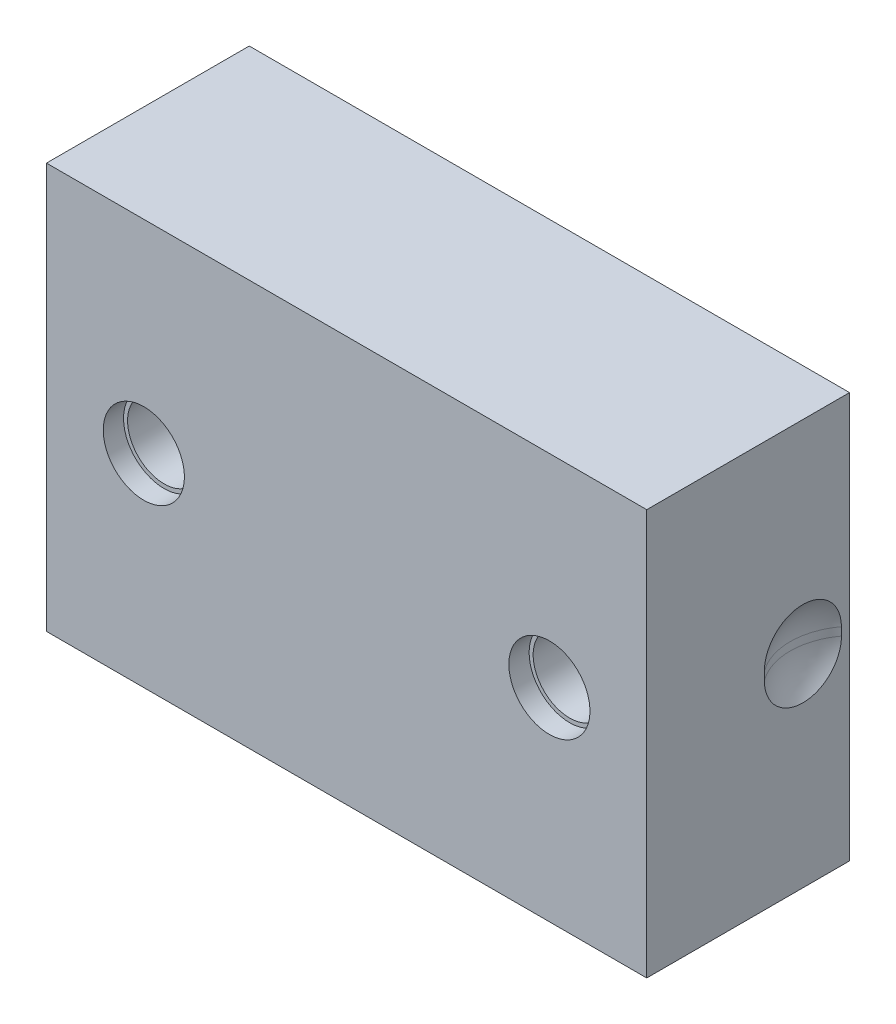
ISO-10303-21;
HEADER;
FILE_DESCRIPTION(('STEP AP214'),'2;1');
FILE_NAME('part.step','',(''),(''),'','','');
FILE_SCHEMA(('AUTOMOTIVE_DESIGN { 1 0 10303 214 1 1 1 1 }'));
ENDSEC;
DATA;
#1=APPLICATION_CONTEXT('core data for automotive mechanical design processes');
#2=APPLICATION_PROTOCOL_DEFINITION('international standard','automotive_design',2000,#1);
#3=PRODUCT_CONTEXT('',#1,'mechanical');
#4=PRODUCT('Part','Part','',(#3));
#5=PRODUCT_RELATED_PRODUCT_CATEGORY('part','',(#4));
#6=PRODUCT_DEFINITION_FORMATION('','',#4);
#7=PRODUCT_DEFINITION_CONTEXT('part definition',#1,'design');
#8=PRODUCT_DEFINITION('design','',#6,#7);
#9=PRODUCT_DEFINITION_SHAPE('','',#8);
#10=(LENGTH_UNIT() NAMED_UNIT(*) SI_UNIT(.MILLI.,.METRE.));
#11=(NAMED_UNIT(*) PLANE_ANGLE_UNIT() SI_UNIT($,.RADIAN.));
#12=(NAMED_UNIT(*) SI_UNIT($,.STERADIAN.) SOLID_ANGLE_UNIT());
#13=UNCERTAINTY_MEASURE_WITH_UNIT(LENGTH_MEASURE(1.E-05),#10,'distance_accuracy_value','');
#14=(GEOMETRIC_REPRESENTATION_CONTEXT(3) GLOBAL_UNCERTAINTY_ASSIGNED_CONTEXT((#13)) GLOBAL_UNIT_ASSIGNED_CONTEXT((#10,
#11,#12)) REPRESENTATION_CONTEXT('',''));
#15=CARTESIAN_POINT('',(0.,0.,0.));
#16=DIRECTION('',(0.,0.,1.));
#17=DIRECTION('',(1.,0.,0.));
#18=AXIS2_PLACEMENT_3D('',#15,#16,#17);
#19=CARTESIAN_POINT('',(-174.500411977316,-24.0004119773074,79.5));
#20=DIRECTION('',(0.,0.,-1.));
#21=DIRECTION('',(-1.,0.,0.));
#22=AXIS2_PLACEMENT_3D('',#19,#20,#21);
#23=PLANE('',#22);
#24=CARTESIAN_POINT('',(-174.500411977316,-24.0004119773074,79.5));
#25=DIRECTION('',(0.,0.,1.));
#26=DIRECTION('',(1.,0.,0.));
#27=AXIS2_PLACEMENT_3D('',#24,#25,#26);
#28=CIRCLE('',#27,9.);
#29=CARTESIAN_POINT('',(-165.500411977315,-24.0004119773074,79.5));
#30=VERTEX_POINT('',#29);
#31=EDGE_CURVE('E18',#30,#30,#28,.T.);
#32=ORIENTED_EDGE('',*,*,#31,.T.);
#33=EDGE_LOOP('',(#32));
#34=FACE_BOUND('',#33,.T.);
#35=CARTESIAN_POINT('',(-174.500411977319,-24.0004119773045,79.4999999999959));
#36=DIRECTION('',(0.,0.,1.));
#37=DIRECTION('',(1.,0.,0.));
#38=AXIS2_PLACEMENT_3D('',#35,#36,#37);
#39=CIRCLE('',#38,6.00000000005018);
#40=CARTESIAN_POINT('',(-168.500411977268,-24.0004119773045,79.4999999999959));
#41=VERTEX_POINT('',#40);
#42=EDGE_CURVE('E288',#41,#41,#39,.F.);
#43=ORIENTED_EDGE('',*,*,#42,.T.);
#44=EDGE_LOOP('',(#43));
#45=FACE_BOUND('',#44,.T.);
#46=ADVANCED_FACE('F14',(#34,#45),#23,.F.);
#47=CARTESIAN_POINT('',(-74.5004119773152,-24.0004119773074,99.5));
#48=DIRECTION('',(0.,0.,1.));
#49=DIRECTION('',(1.,0.,0.));
#50=AXIS2_PLACEMENT_3D('',#47,#48,#49);
#51=CYLINDRICAL_SURFACE('',#50,9.);
#52=CARTESIAN_POINT('',(-74.5004119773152,-24.0004119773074,79.5));
#53=DIRECTION('',(0.,0.,1.));
#54=DIRECTION('',(1.,0.,0.));
#55=AXIS2_PLACEMENT_3D('',#52,#53,#54);
#56=CIRCLE('',#55,9.);
#57=CARTESIAN_POINT('',(-65.5004119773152,-24.0004119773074,79.5));
#58=VERTEX_POINT('',#57);
#59=EDGE_CURVE('E290',#58,#58,#56,.F.);
#60=ORIENTED_EDGE('',*,*,#59,.T.);
#61=EDGE_LOOP('',(#60));
#62=FACE_BOUND('',#61,.T.);
#63=CARTESIAN_POINT('',(-74.5004119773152,-24.0004119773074,114.5));
#64=DIRECTION('',(0.,0.,1.));
#65=DIRECTION('',(1.,0.,0.));
#66=AXIS2_PLACEMENT_3D('',#63,#64,#65);
#67=CIRCLE('',#66,9.);
#68=CARTESIAN_POINT('',(-65.5004119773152,-24.0004119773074,114.5));
#69=VERTEX_POINT('',#68);
#70=EDGE_CURVE('E285',#69,#69,#67,.T.);
#71=ORIENTED_EDGE('',*,*,#70,.T.);
#72=EDGE_LOOP('',(#71));
#73=FACE_BOUND('',#72,.T.);
#74=ADVANCED_FACE('F303',(#62,#73),#51,.F.);
#75=CARTESIAN_POINT('',(-174.500411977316,-24.0004119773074,99.5));
#76=DIRECTION('',(0.,0.,1.));
#77=DIRECTION('',(1.,0.,0.));
#78=AXIS2_PLACEMENT_3D('',#75,#76,#77);
#79=CYLINDRICAL_SURFACE('',#78,9.);
#80=ORIENTED_EDGE('',*,*,#31,.F.);
#81=EDGE_LOOP('',(#80));
#82=FACE_BOUND('',#81,.T.);
#83=CARTESIAN_POINT('',(-174.500411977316,-24.0004119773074,114.5));
#84=DIRECTION('',(0.,0.,1.));
#85=DIRECTION('',(1.,0.,0.));
#86=AXIS2_PLACEMENT_3D('',#83,#84,#85);
#87=CIRCLE('',#86,9.);
#88=CARTESIAN_POINT('',(-165.500411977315,-24.0004119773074,114.5));
#89=VERTEX_POINT('',#88);
#90=EDGE_CURVE('E282',#89,#89,#87,.T.);
#91=ORIENTED_EDGE('',*,*,#90,.T.);
#92=EDGE_LOOP('',(#91));
#93=FACE_BOUND('',#92,.T.);
#94=ADVANCED_FACE('F299',(#82,#93),#79,.F.);
#95=CARTESIAN_POINT('',(-74.5004119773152,-24.0004119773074,79.5));
#96=DIRECTION('',(0.,0.,-1.));
#97=DIRECTION('',(-1.,0.,0.));
#98=AXIS2_PLACEMENT_3D('',#95,#96,#97);
#99=PLANE('',#98);
#100=ORIENTED_EDGE('',*,*,#59,.F.);
#101=EDGE_LOOP('',(#100));
#102=FACE_BOUND('',#101,.T.);
#103=CARTESIAN_POINT('',(-74.5004119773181,-24.0004119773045,79.5000000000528));
#104=DIRECTION('',(0.,0.,1.));
#105=DIRECTION('',(1.,0.,0.));
#106=AXIS2_PLACEMENT_3D('',#103,#104,#105);
#107=CIRCLE('',#106,6.0000000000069);
#108=CARTESIAN_POINT('',(-68.5004119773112,-24.0004119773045,79.5000000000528));
#109=VERTEX_POINT('',#108);
#110=EDGE_CURVE('E215',#109,#109,#107,.F.);
#111=ORIENTED_EDGE('',*,*,#110,.T.);
#112=EDGE_LOOP('',(#111));
#113=FACE_BOUND('',#112,.T.);
#114=ADVANCED_FACE('F302',(#102,#113),#99,.F.);
#115=CARTESIAN_POINT('',(-174.500411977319,-24.0004119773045,79.4999999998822));
#116=DIRECTION('',(0.,0.,1.));
#117=DIRECTION('',(1.,0.,0.));
#118=AXIS2_PLACEMENT_3D('',#115,#116,#117);
#119=CONICAL_SURFACE('',#118,5.99999999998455,0.523598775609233);
#120=ORIENTED_EDGE('',*,*,#42,.F.);
#121=EDGE_LOOP('',(#120));
#122=FACE_BOUND('',#121,.T.);
#123=CARTESIAN_POINT('',(-174.500411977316,-24.0004119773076,78.2009618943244));
#124=DIRECTION('',(1.81804897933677E-13,-1.75169682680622E-13,-1.));
#125=DIRECTION('',(-1.,0.,-1.81804897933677E-13));
#126=AXIS2_PLACEMENT_3D('',#123,#124,#125);
#127=CIRCLE('',#126,5.25);
#128=CARTESIAN_POINT('',(-179.750411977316,-24.0004119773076,78.2009618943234));
#129=VERTEX_POINT('',#128);
#130=EDGE_CURVE('E211',#129,#129,#127,.T.);
#131=ORIENTED_EDGE('',*,*,#130,.T.);
#132=EDGE_LOOP('',(#131));
#133=FACE_BOUND('',#132,.T.);
#134=ADVANCED_FACE('F321',(#122,#133),#119,.F.);
#135=CARTESIAN_POINT('',(-74.5004119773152,-24.0004119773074,114.5));
#136=DIRECTION('',(0.,0.,-1.));
#137=DIRECTION('',(-1.,0.,0.));
#138=AXIS2_PLACEMENT_3D('',#135,#136,#137);
#139=PLANE('',#138);
#140=CARTESIAN_POINT('',(-74.5004119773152,-24.0004119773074,114.5));
#141=DIRECTION('',(0.,0.,-1.));
#142=DIRECTION('',(-1.,0.,0.));
#143=AXIS2_PLACEMENT_3D('',#140,#141,#142);
#144=CIRCLE('',#143,10.);
#145=CARTESIAN_POINT('',(-84.5004119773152,-24.0004119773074,114.5));
#146=VERTEX_POINT('',#145);
#147=EDGE_CURVE('E214',#146,#146,#144,.F.);
#148=ORIENTED_EDGE('',*,*,#147,.T.);
#149=EDGE_LOOP('',(#148));
#150=FACE_BOUND('',#149,.T.);
#151=ORIENTED_EDGE('',*,*,#70,.F.);
#152=EDGE_LOOP('',(#151));
#153=FACE_BOUND('',#152,.T.);
#154=ADVANCED_FACE('F310',(#150,#153),#139,.F.);
#155=CARTESIAN_POINT('',(-174.500411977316,-24.0004119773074,114.5));
#156=DIRECTION('',(0.,0.,-1.));
#157=DIRECTION('',(-1.,0.,0.));
#158=AXIS2_PLACEMENT_3D('',#155,#156,#157);
#159=PLANE('',#158);
#160=CARTESIAN_POINT('',(-174.500411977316,-24.0004119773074,114.5));
#161=DIRECTION('',(0.,0.,-1.));
#162=DIRECTION('',(-1.,0.,0.));
#163=AXIS2_PLACEMENT_3D('',#160,#161,#162);
#164=CIRCLE('',#163,10.);
#165=CARTESIAN_POINT('',(-184.500411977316,-24.0004119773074,114.5));
#166=VERTEX_POINT('',#165);
#167=EDGE_CURVE('E218',#166,#166,#164,.F.);
#168=ORIENTED_EDGE('',*,*,#167,.T.);
#169=EDGE_LOOP('',(#168));
#170=FACE_BOUND('',#169,.T.);
#171=ORIENTED_EDGE('',*,*,#90,.F.);
#172=EDGE_LOOP('',(#171));
#173=FACE_BOUND('',#172,.T.);
#174=ADVANCED_FACE('F307',(#170,#173),#159,.F.);
#175=CARTESIAN_POINT('',(-74.5004119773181,-24.0004119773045,79.5000000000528));
#176=DIRECTION('',(0.,0.,1.));
#177=DIRECTION('',(1.,0.,0.));
#178=AXIS2_PLACEMENT_3D('',#175,#176,#177);
#179=CONICAL_SURFACE('',#178,6.0000000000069,0.523598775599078);
#180=ORIENTED_EDGE('',*,*,#110,.F.);
#181=EDGE_LOOP('',(#180));
#182=FACE_BOUND('',#181,.T.);
#183=CARTESIAN_POINT('',(-74.5004119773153,-24.0004119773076,78.2009618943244));
#184=DIRECTION('',(1.81804897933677E-13,-1.75169682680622E-13,-1.));
#185=DIRECTION('',(-1.,0.,-1.81804897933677E-13));
#186=AXIS2_PLACEMENT_3D('',#183,#184,#185);
#187=CIRCLE('',#186,5.25);
#188=CARTESIAN_POINT('',(-79.7504119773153,-24.0004119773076,78.2009618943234));
#189=VERTEX_POINT('',#188);
#190=EDGE_CURVE('E216',#189,#189,#187,.T.);
#191=ORIENTED_EDGE('',*,*,#190,.T.);
#192=EDGE_LOOP('',(#191));
#193=FACE_BOUND('',#192,.T.);
#194=ADVANCED_FACE('F309',(#182,#193),#179,.F.);
#195=CARTESIAN_POINT('',(-174.500411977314,-24.0004119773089,71.));
#196=DIRECTION('',(1.81804897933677E-13,-1.75169682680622E-13,-1.));
#197=DIRECTION('',(-1.,0.,-1.81804897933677E-13));
#198=AXIS2_PLACEMENT_3D('',#195,#196,#197);
#199=CYLINDRICAL_SURFACE('',#198,5.25);
#200=CARTESIAN_POINT('',(-174.500411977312,-24.0004119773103,62.4999999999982));
#201=DIRECTION('',(1.81804897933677E-13,-1.75169682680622E-13,-1.));
#202=DIRECTION('',(-1.,0.,-1.81804897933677E-13));
#203=AXIS2_PLACEMENT_3D('',#200,#201,#202);
#204=CIRCLE('',#203,5.25);
#205=CARTESIAN_POINT('',(-179.750411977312,-24.0004119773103,62.4999999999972));
#206=VERTEX_POINT('',#205);
#207=EDGE_CURVE('E80',#206,#206,#204,.F.);
#208=ORIENTED_EDGE('',*,*,#207,.F.);
#209=EDGE_LOOP('',(#208));
#210=FACE_BOUND('',#209,.T.);
#211=ORIENTED_EDGE('',*,*,#130,.F.);
#212=EDGE_LOOP('',(#211));
#213=FACE_BOUND('',#212,.T.);
#214=ADVANCED_FACE('F318',(#210,#213),#199,.F.);
#215=CARTESIAN_POINT('',(-74.5004119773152,-24.0004119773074,117.));
#216=DIRECTION('',(0.,0.,-1.));
#217=DIRECTION('',(-1.,0.,0.));
#218=AXIS2_PLACEMENT_3D('',#215,#216,#217);
#219=CYLINDRICAL_SURFACE('',#218,10.);
#220=CARTESIAN_POINT('',(-74.5004119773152,-24.0004119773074,119.5));
#221=DIRECTION('',(0.,0.,-1.));
#222=DIRECTION('',(-1.,0.,0.));
#223=AXIS2_PLACEMENT_3D('',#220,#221,#222);
#224=CIRCLE('',#223,10.);
#225=CARTESIAN_POINT('',(-84.5004119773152,-24.0004119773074,119.5));
#226=VERTEX_POINT('',#225);
#227=EDGE_CURVE('E265',#226,#226,#224,.F.);
#228=ORIENTED_EDGE('',*,*,#227,.T.);
#229=EDGE_LOOP('',(#228));
#230=FACE_BOUND('',#229,.T.);
#231=ORIENTED_EDGE('',*,*,#147,.F.);
#232=EDGE_LOOP('',(#231));
#233=FACE_BOUND('',#232,.T.);
#234=ADVANCED_FACE('F328',(#230,#233),#219,.F.);
#235=CARTESIAN_POINT('',(-174.500411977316,-24.0004119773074,117.));
#236=DIRECTION('',(0.,0.,-1.));
#237=DIRECTION('',(-1.,0.,0.));
#238=AXIS2_PLACEMENT_3D('',#235,#236,#237);
#239=CYLINDRICAL_SURFACE('',#238,10.);
#240=CARTESIAN_POINT('',(-174.500411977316,-24.0004119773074,119.5));
#241=DIRECTION('',(0.,0.,-1.));
#242=DIRECTION('',(-1.,0.,0.));
#243=AXIS2_PLACEMENT_3D('',#240,#241,#242);
#244=CIRCLE('',#243,10.);
#245=CARTESIAN_POINT('',(-184.500411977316,-24.0004119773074,119.5));
#246=VERTEX_POINT('',#245);
#247=EDGE_CURVE('E268',#246,#246,#244,.F.);
#248=ORIENTED_EDGE('',*,*,#247,.T.);
#249=EDGE_LOOP('',(#248));
#250=FACE_BOUND('',#249,.T.);
#251=ORIENTED_EDGE('',*,*,#167,.F.);
#252=EDGE_LOOP('',(#251));
#253=FACE_BOUND('',#252,.T.);
#254=ADVANCED_FACE('F332',(#250,#253),#239,.F.);
#255=CARTESIAN_POINT('',(-74.500411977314,-24.0004119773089,71.));
#256=DIRECTION('',(1.81804897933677E-13,-1.75169682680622E-13,-1.));
#257=DIRECTION('',(-1.,0.,-1.81804897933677E-13));
#258=AXIS2_PLACEMENT_3D('',#255,#256,#257);
#259=CYLINDRICAL_SURFACE('',#258,5.25);
#260=CARTESIAN_POINT('',(-74.5004119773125,-24.0004119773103,62.4999999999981));
#261=DIRECTION('',(1.81804897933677E-13,-1.75169682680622E-13,-1.));
#262=DIRECTION('',(-1.,0.,-1.81804897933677E-13));
#263=AXIS2_PLACEMENT_3D('',#260,#261,#262);
#264=CIRCLE('',#263,5.25);
#265=CARTESIAN_POINT('',(-79.7504119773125,-24.0004119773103,62.4999999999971));
#266=VERTEX_POINT('',#265);
#267=EDGE_CURVE('E540',#266,#266,#264,.F.);
#268=ORIENTED_EDGE('',*,*,#267,.F.);
#269=EDGE_LOOP('',(#268));
#270=FACE_BOUND('',#269,.T.);
#271=ORIENTED_EDGE('',*,*,#190,.F.);
#272=EDGE_LOOP('',(#271));
#273=FACE_BOUND('',#272,.T.);
#274=ADVANCED_FACE('F336',(#270,#273),#259,.F.);
#275=CARTESIAN_POINT('',(-166.045797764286,-20.9150435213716,62.5));
#276=DIRECTION('',(0.,0.,-1.));
#277=DIRECTION('',(-1.,0.,0.));
#278=AXIS2_PLACEMENT_3D('',#275,#276,#277);
#279=PLANE('',#278);
#280=CARTESIAN_POINT('',(-174.500411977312,-24.0004119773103,62.5));
#281=DIRECTION('',(0.,0.,-1.));
#282=DIRECTION('',(-1.,0.,0.));
#283=AXIS2_PLACEMENT_3D('',#280,#281,#282);
#284=CIRCLE('',#283,9.);
#285=CARTESIAN_POINT('',(-183.500411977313,-24.0004119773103,62.5));
#286=VERTEX_POINT('',#285);
#287=EDGE_CURVE('E89',#286,#286,#284,.F.);
#288=ORIENTED_EDGE('',*,*,#287,.F.);
#289=EDGE_LOOP('',(#288));
#290=FACE_BOUND('',#289,.T.);
#291=ORIENTED_EDGE('',*,*,#207,.T.);
#292=EDGE_LOOP('',(#291));
#293=FACE_BOUND('',#292,.T.);
#294=ADVANCED_FACE('F339',(#290,#293),#279,.T.);
#295=CARTESIAN_POINT('',(-211.250411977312,-25.0005435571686,81.));
#296=DIRECTION('',(0.496405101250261,0.278948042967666,0.822052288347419));
#297=DIRECTION('',(0.0314750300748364,0.940559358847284,-0.338167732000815));
#298=AXIS2_PLACEMENT_3D('',#295,#296,#297);
#299=SPHERICAL_SURFACE('',#298,15.9);
#300=CARTESIAN_POINT('',(-211.250411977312,-25.0005435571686,81.));
#301=DIRECTION('',(0.,-1.,0.));
#302=DIRECTION('',(0.,0.,-1.));
#303=AXIS2_PLACEMENT_3D('',#300,#301,#302);
#304=CIRCLE('',#303,15.9);
#305=CARTESIAN_POINT('',(-198.500411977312,-25.0005435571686,90.4998684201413));
#306=VERTEX_POINT('',#305);
#307=CARTESIAN_POINT('',(-198.500411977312,-25.0005435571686,71.5001315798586));
#308=VERTEX_POINT('',#307);
#309=EDGE_CURVE('E74',#306,#308,#304,.F.);
#310=ORIENTED_EDGE('',*,*,#309,.T.);
#311=CARTESIAN_POINT('',(-198.500411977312,-25.0005435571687,71.5001315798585));
#312=CARTESIAN_POINT('',(-198.500411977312,-25.2677303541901,71.5001028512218));
#313=CARTESIAN_POINT('',(-198.500411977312,-25.5349130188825,71.5114024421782));
#314=CARTESIAN_POINT('',(-198.500411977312,-26.0673668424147,71.556450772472));
#315=CARTESIAN_POINT('',(-198.500411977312,-26.3326380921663,71.5901984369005));
#316=CARTESIAN_POINT('',(-198.500411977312,-26.8592066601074,71.6799039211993));
#317=CARTESIAN_POINT('',(-198.500411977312,-27.1205066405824,71.7358461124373));
#318=CARTESIAN_POINT('',(-198.500411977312,-27.6374645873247,71.8695336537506));
#319=CARTESIAN_POINT('',(-198.500411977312,-27.8931226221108,71.9472787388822));
#320=CARTESIAN_POINT('',(-198.500411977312,-28.3970996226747,72.1240632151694));
#321=CARTESIAN_POINT('',(-198.500411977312,-28.6454151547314,72.2231123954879));
#322=CARTESIAN_POINT('',(-198.500411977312,-29.1328237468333,72.4417813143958));
#323=CARTESIAN_POINT('',(-198.500411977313,-29.3719166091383,72.5614014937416));
#324=CARTESIAN_POINT('',(-198.500411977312,-29.8391260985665,72.8203339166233));
#325=CARTESIAN_POINT('',(-198.500411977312,-30.0672449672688,72.9596421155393));
#326=CARTESIAN_POINT('',(-198.500411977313,-30.5109364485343,73.2569781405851));
#327=CARTESIAN_POINT('',(-198.500411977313,-30.7265091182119,73.4150058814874));
#328=CARTESIAN_POINT('',(-198.500411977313,-31.1435843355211,73.7486640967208));
#329=CARTESIAN_POINT('',(-198.500411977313,-31.3450863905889,73.924295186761));
#330=CARTESIAN_POINT('',(-198.500411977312,-31.7325755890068,74.2919030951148));
#331=CARTESIAN_POINT('',(-198.500411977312,-31.9185630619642,74.4838795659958));
#332=CARTESIAN_POINT('',(-198.500411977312,-32.2737349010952,74.8828494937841));
#333=CARTESIAN_POINT('',(-198.500411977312,-32.442916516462,75.0898453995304));
#334=CARTESIAN_POINT('',(-198.500411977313,-32.7632390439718,75.5173545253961));
#335=CARTESIAN_POINT('',(-198.500411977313,-32.9143799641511,75.7378677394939));
#336=CARTESIAN_POINT('',(-198.500411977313,-33.1975402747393,76.1908336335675));
#337=CARTESIAN_POINT('',(-198.500411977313,-33.329560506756,76.4232857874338));
#338=CARTESIAN_POINT('',(-198.500411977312,-33.5735487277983,76.8984858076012));
#339=CARTESIAN_POINT('',(-198.500411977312,-33.6855167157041,77.1412336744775));
#340=CARTESIAN_POINT('',(-198.500411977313,-33.8885978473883,77.6352833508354));
#341=CARTESIAN_POINT('',(-198.500411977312,-33.9797123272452,77.8865846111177));
#342=CARTESIAN_POINT('',(-198.500411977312,-34.1404478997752,78.3959693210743));
#343=CARTESIAN_POINT('',(-198.500411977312,-34.2100689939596,78.6540527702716));
#344=CARTESIAN_POINT('',(-198.500411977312,-34.3273240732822,79.1751725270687));
#345=CARTESIAN_POINT('',(-198.500411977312,-34.3749576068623,79.4382089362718));
#346=CARTESIAN_POINT('',(-198.500411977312,-34.4478968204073,79.96735948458));
#347=CARTESIAN_POINT('',(-198.500411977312,-34.4732024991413,80.2334736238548));
#348=CARTESIAN_POINT('',(-198.500411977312,-34.5013064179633,80.7668938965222));
#349=CARTESIAN_POINT('',(-198.500411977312,-34.5041041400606,81.0342000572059));
#350=CARTESIAN_POINT('',(-198.500411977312,-34.4871708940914,81.5680978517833));
#351=CARTESIAN_POINT('',(-198.500411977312,-34.4674399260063,81.8346894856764));
#352=CARTESIAN_POINT('',(-198.500411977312,-34.4055898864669,82.3652602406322));
#353=CARTESIAN_POINT('',(-198.500411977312,-34.3634710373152,82.6292393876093));
#354=CARTESIAN_POINT('',(-198.500411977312,-34.2571448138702,83.1527111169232));
#355=CARTESIAN_POINT('',(-198.500411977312,-34.1929374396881,83.4122036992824));
#356=CARTESIAN_POINT('',(-198.500411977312,-34.0428908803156,83.9248566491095));
#357=CARTESIAN_POINT('',(-198.500411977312,-33.9570517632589,84.178017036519));
#358=CARTESIAN_POINT('',(-198.500411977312,-33.7643518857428,84.6762066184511));
#359=CARTESIAN_POINT('',(-198.500411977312,-33.6574911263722,84.9212358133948));
#360=CARTESIAN_POINT('',(-198.500411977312,-33.4235058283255,85.4014248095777));
#361=CARTESIAN_POINT('',(-198.500411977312,-33.2963809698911,85.6365844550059));
#362=CARTESIAN_POINT('',(-198.500411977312,-33.0227696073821,86.0953631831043));
#363=CARTESIAN_POINT('',(-198.500411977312,-32.8762826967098,86.3189820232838));
#364=CARTESIAN_POINT('',(-198.500411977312,-32.5649999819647,86.7530711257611));
#365=CARTESIAN_POINT('',(-198.500411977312,-32.4002052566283,86.9635421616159));
#366=CARTESIAN_POINT('',(-198.500411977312,-32.0534717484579,87.3698533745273));
#367=CARTESIAN_POINT('',(-198.500411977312,-31.8715329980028,87.565693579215));
#368=CARTESIAN_POINT('',(-198.500411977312,-31.4918300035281,87.9413261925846));
#369=CARTESIAN_POINT('',(-198.500411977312,-31.2940678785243,88.1211207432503));
#370=CARTESIAN_POINT('',(-198.500411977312,-30.8841024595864,88.4634136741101));
#371=CARTESIAN_POINT('',(-198.500411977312,-30.6718991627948,88.6259120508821));
#372=CARTESIAN_POINT('',(-198.500411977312,-30.2344865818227,88.932508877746));
#373=CARTESIAN_POINT('',(-198.500411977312,-30.0092729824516,89.0766011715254));
#374=CARTESIAN_POINT('',(-198.500411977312,-29.5475128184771,89.3452934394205));
#375=CARTESIAN_POINT('',(-198.500411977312,-29.3109665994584,89.4698940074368));
#376=CARTESIAN_POINT('',(-198.500411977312,-28.8280635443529,89.6987950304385));
#377=CARTESIAN_POINT('',(-198.500411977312,-28.5817005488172,89.8030824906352));
#378=CARTESIAN_POINT('',(-198.500411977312,-28.0810642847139,89.9905132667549));
#379=CARTESIAN_POINT('',(-198.500411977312,-27.8267912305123,90.0736571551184));
#380=CARTESIAN_POINT('',(-198.500411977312,-27.3124764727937,90.2181196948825));
#381=CARTESIAN_POINT('',(-198.500411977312,-27.0524425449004,90.2794660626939));
#382=CARTESIAN_POINT('',(-198.500411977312,-26.5282358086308,90.3800228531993));
#383=CARTESIAN_POINT('',(-198.500411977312,-26.2640650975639,90.4192441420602));
#384=CARTESIAN_POINT('',(-198.500411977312,-25.8328568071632,90.4648086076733));
#385=CARTESIAN_POINT('',(-198.500411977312,-25.666509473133,90.4779644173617));
#386=CARTESIAN_POINT('',(-198.500411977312,-25.3336283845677,90.4954880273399));
#387=CARTESIAN_POINT('',(-198.500411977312,-25.167095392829,90.4998703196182));
#388=CARTESIAN_POINT('',(-198.500411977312,-25.0005435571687,90.4998684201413));
#389=B_SPLINE_CURVE_WITH_KNOTS('',3,(#311,#312,#313,#314,#315,#316,#317,#318,#319,#320,#321,
#322,#323,#324,#325,#326,#327,#328,#329,#330,#331,#332,#333,#334,#335,#336,#337,#338,#339,#340,
#341,#342,#343,#344,#345,#346,#347,#348,#349,#350,#351,#352,#353,#354,#355,#356,#357,#358,#359,
#360,#361,#362,#363,#364,#365,#366,#367,#368,#369,#370,#371,#372,#373,#374,#375,#376,#377,#378,
#379,#380,#381,#382,#383,#384,#385,#386,#387,#388),.UNSPECIFIED.,.F.,.F.,(4,2,2,2,2,2,2,2,2,2,2,
2,2,2,2,2,2,2,2,2,2,2,2,2,2,2,2,2,2,2,2,2,2,2,2,2,2,2,4),(0.,0.801315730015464,1.60259309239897,
2.40330722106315,3.20401162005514,4.00508472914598,4.80617500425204,5.6071009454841,
6.40802324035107,7.20897355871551,8.00990685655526,8.81097103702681,9.61203486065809,
10.4130634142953,11.214092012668,12.0150692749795,12.8160464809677,13.6170401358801,
14.4180338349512,15.2190459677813,16.0200581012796,16.8210622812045,17.6220664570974,
18.4230681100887,19.2240697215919,20.0250839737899,20.8261150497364,21.6270989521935,
22.4280813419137,23.2289566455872,24.0298321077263,24.8309747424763,25.632092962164,
26.4337220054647,27.2353293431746,28.0359137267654,28.8361045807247,29.3364921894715,
29.8360525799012),.UNSPECIFIED.);
#390=EDGE_CURVE('E72',#308,#306,#389,.T.);
#391=ORIENTED_EDGE('',*,*,#390,.T.);
#392=EDGE_LOOP('',(#310,#391));
#393=FACE_BOUND('',#392,.T.);
#394=ADVANCED_FACE('F76',(#393),#299,.F.);
#395=CARTESIAN_POINT('',(-211.250411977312,8.66438002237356,81.));
#396=DIRECTION('',(0.,-1.,0.));
#397=DIRECTION('',(0.,0.,-1.));
#398=AXIS2_PLACEMENT_3D('',#395,#396,#397);
#399=CYLINDRICAL_SURFACE('',#398,15.9);
#400=ORIENTED_EDGE('',*,*,#309,.F.);
#401=DIRECTION('',(0.,1.,0.));
#402=VECTOR('',#401,1.);
#403=CARTESIAN_POINT('',(-198.500411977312,-24.0004119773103,90.4998684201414));
#404=LINE('',#403,#402);
#405=CARTESIAN_POINT('',(-198.500411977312,-23.0002803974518,90.4998684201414));
#406=VERTEX_POINT('',#405);
#407=EDGE_CURVE('E92',#306,#406,#404,.T.);
#408=ORIENTED_EDGE('',*,*,#407,.T.);
#409=CARTESIAN_POINT('',(-211.250411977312,-23.0002803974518,81.));
#410=DIRECTION('',(0.,-1.,0.));
#411=DIRECTION('',(0.,0.,-1.));
#412=AXIS2_PLACEMENT_3D('',#409,#410,#411);
#413=CIRCLE('',#412,15.9);
#414=CARTESIAN_POINT('',(-198.500411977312,-23.0002803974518,71.5001315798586));
#415=VERTEX_POINT('',#414);
#416=EDGE_CURVE('E79',#406,#415,#413,.F.);
#417=ORIENTED_EDGE('',*,*,#416,.T.);
#418=DIRECTION('',(0.,1.,0.));
#419=VECTOR('',#418,1.);
#420=CARTESIAN_POINT('',(-198.500411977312,-24.0004119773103,71.5001315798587));
#421=LINE('',#420,#419);
#422=EDGE_CURVE('E83',#415,#308,#421,.F.);
#423=ORIENTED_EDGE('',*,*,#422,.T.);
#424=EDGE_LOOP('',(#400,#408,#417,#423));
#425=FACE_BOUND('',#424,.T.);
#426=ADVANCED_FACE('F84',(#425),#399,.F.);
#427=CARTESIAN_POINT('',(-211.250411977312,-23.0002803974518,81.));
#428=DIRECTION('',(0.496405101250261,0.278948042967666,0.822052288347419));
#429=DIRECTION('',(0.0314750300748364,0.940559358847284,-0.338167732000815));
#430=AXIS2_PLACEMENT_3D('',#427,#428,#429);
#431=SPHERICAL_SURFACE('',#430,15.9);
#432=ORIENTED_EDGE('',*,*,#416,.F.);
#433=CARTESIAN_POINT('',(-198.500411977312,-23.0002803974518,90.4998684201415));
#434=CARTESIAN_POINT('',(-198.500411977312,-22.7330936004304,90.4998971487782));
#435=CARTESIAN_POINT('',(-198.500411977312,-22.465910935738,90.4885975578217));
#436=CARTESIAN_POINT('',(-198.500411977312,-21.9334571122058,90.4435492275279));
#437=CARTESIAN_POINT('',(-198.500411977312,-21.6681858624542,90.4098015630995));
#438=CARTESIAN_POINT('',(-198.500411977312,-21.1416172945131,90.3200960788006));
#439=CARTESIAN_POINT('',(-198.500411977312,-20.8803173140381,90.2641538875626));
#440=CARTESIAN_POINT('',(-198.500411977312,-20.3633593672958,90.1304663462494));
#441=CARTESIAN_POINT('',(-198.500411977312,-20.1077013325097,90.052721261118));
#442=CARTESIAN_POINT('',(-198.500411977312,-19.6037243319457,89.8759367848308));
#443=CARTESIAN_POINT('',(-198.500411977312,-19.3554087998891,89.7768876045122));
#444=CARTESIAN_POINT('',(-198.500411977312,-18.8680002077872,89.5582186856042));
#445=CARTESIAN_POINT('',(-198.500411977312,-18.6289073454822,89.4385985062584));
#446=CARTESIAN_POINT('',(-198.500411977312,-18.1616978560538,89.1796660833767));
#447=CARTESIAN_POINT('',(-198.500411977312,-17.9335789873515,89.0403578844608));
#448=CARTESIAN_POINT('',(-198.500411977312,-17.4898875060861,88.7430218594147));
#449=CARTESIAN_POINT('',(-198.500411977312,-17.2743148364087,88.584994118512));
#450=CARTESIAN_POINT('',(-198.500411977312,-16.8572396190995,88.2513359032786));
#451=CARTESIAN_POINT('',(-198.500411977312,-16.6557375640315,88.0757048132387));
#452=CARTESIAN_POINT('',(-198.500411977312,-16.2682483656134,87.7080969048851));
#453=CARTESIAN_POINT('',(-198.500411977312,-16.0822608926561,87.5161204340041));
#454=CARTESIAN_POINT('',(-198.500411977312,-15.7270890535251,87.1171505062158));
#455=CARTESIAN_POINT('',(-198.500411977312,-15.5579074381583,86.9101546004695));
#456=CARTESIAN_POINT('',(-198.500411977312,-15.2375849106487,86.4826454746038));
#457=CARTESIAN_POINT('',(-198.500411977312,-15.0864439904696,86.2621322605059));
#458=CARTESIAN_POINT('',(-198.500411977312,-14.8032836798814,85.8091663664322));
#459=CARTESIAN_POINT('',(-198.500411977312,-14.6712634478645,85.5767142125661));
#460=CARTESIAN_POINT('',(-198.500411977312,-14.427275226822,85.1015141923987));
#461=CARTESIAN_POINT('',(-198.500411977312,-14.3153072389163,84.8587663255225));
#462=CARTESIAN_POINT('',(-198.500411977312,-14.1122261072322,84.3647166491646));
#463=CARTESIAN_POINT('',(-198.500411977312,-14.0211116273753,84.1134153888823));
#464=CARTESIAN_POINT('',(-198.500411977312,-13.8603760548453,83.6040306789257));
#465=CARTESIAN_POINT('',(-198.500411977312,-13.7907549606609,83.3459472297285));
#466=CARTESIAN_POINT('',(-198.500411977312,-13.6734998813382,82.8248274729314));
#467=CARTESIAN_POINT('',(-198.500411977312,-13.6258663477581,82.5617910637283));
#468=CARTESIAN_POINT('',(-198.500411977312,-13.5529271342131,82.0326405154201));
#469=CARTESIAN_POINT('',(-198.500411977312,-13.5276214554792,81.7665263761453));
#470=CARTESIAN_POINT('',(-198.500411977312,-13.4995175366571,81.2331061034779));
#471=CARTESIAN_POINT('',(-198.500411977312,-13.4967198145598,80.9657999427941));
#472=CARTESIAN_POINT('',(-198.500411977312,-13.513653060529,80.4319021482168));
#473=CARTESIAN_POINT('',(-198.500411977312,-13.5333840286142,80.1653105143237));
#474=CARTESIAN_POINT('',(-198.500411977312,-13.5952340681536,79.6347397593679));
#475=CARTESIAN_POINT('',(-198.500411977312,-13.6373529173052,79.3707606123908));
#476=CARTESIAN_POINT('',(-198.500411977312,-13.7436791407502,78.8472888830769));
#477=CARTESIAN_POINT('',(-198.500411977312,-13.8078865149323,78.5877963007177));
#478=CARTESIAN_POINT('',(-198.500411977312,-13.9579330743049,78.0751433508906));
#479=CARTESIAN_POINT('',(-198.500411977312,-14.0437721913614,77.821982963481));
#480=CARTESIAN_POINT('',(-198.500411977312,-14.2364720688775,77.323793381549));
#481=CARTESIAN_POINT('',(-198.500411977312,-14.3433328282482,77.0787641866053));
#482=CARTESIAN_POINT('',(-198.500411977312,-14.5773181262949,76.5985751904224));
#483=CARTESIAN_POINT('',(-198.500411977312,-14.7044429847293,76.3634155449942));
#484=CARTESIAN_POINT('',(-198.500411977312,-14.9780543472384,75.9046368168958));
#485=CARTESIAN_POINT('',(-198.500411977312,-15.1245412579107,75.6810179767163));
#486=CARTESIAN_POINT('',(-198.500411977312,-15.4358239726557,75.2469288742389));
#487=CARTESIAN_POINT('',(-198.500411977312,-15.6006186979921,75.0364578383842));
#488=CARTESIAN_POINT('',(-198.500411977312,-15.9473522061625,74.6301466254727));
#489=CARTESIAN_POINT('',(-198.500411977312,-16.1292909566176,74.434306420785));
#490=CARTESIAN_POINT('',(-198.500411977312,-16.5089939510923,74.0586738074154));
#491=CARTESIAN_POINT('',(-198.500411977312,-16.7067560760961,73.8788792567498));
#492=CARTESIAN_POINT('',(-198.500411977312,-17.1167214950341,73.5365863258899));
#493=CARTESIAN_POINT('',(-198.500411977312,-17.3289247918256,73.3740879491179));
#494=CARTESIAN_POINT('',(-198.500411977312,-17.7663373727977,73.0674911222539));
#495=CARTESIAN_POINT('',(-198.500411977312,-17.9915509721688,72.9233988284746));
#496=CARTESIAN_POINT('',(-198.500411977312,-18.4533111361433,72.6547065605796));
#497=CARTESIAN_POINT('',(-198.500411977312,-18.6898573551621,72.5301059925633));
#498=CARTESIAN_POINT('',(-198.500411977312,-19.1727604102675,72.3012049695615));
#499=CARTESIAN_POINT('',(-198.500411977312,-19.4191234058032,72.1969175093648));
#500=CARTESIAN_POINT('',(-198.500411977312,-19.9197596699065,72.009486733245));
#501=CARTESIAN_POINT('',(-198.500411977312,-20.1740327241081,71.9263428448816));
#502=CARTESIAN_POINT('',(-198.500411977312,-20.6883474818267,71.7818803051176));
#503=CARTESIAN_POINT('',(-198.500411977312,-20.94838140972,71.7205339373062));
#504=CARTESIAN_POINT('',(-198.500411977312,-21.4725881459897,71.6199771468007));
#505=CARTESIAN_POINT('',(-198.500411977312,-21.7367588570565,71.5807558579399));
#506=CARTESIAN_POINT('',(-198.500411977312,-22.1679671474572,71.5351913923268));
#507=CARTESIAN_POINT('',(-198.500411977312,-22.3343144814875,71.5220355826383));
#508=CARTESIAN_POINT('',(-198.500411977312,-22.6671955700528,71.5045119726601));
#509=CARTESIAN_POINT('',(-198.500411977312,-22.8337285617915,71.5001296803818));
#510=CARTESIAN_POINT('',(-198.500411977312,-23.0002803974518,71.5001315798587));
#511=B_SPLINE_CURVE_WITH_KNOTS('',3,(#433,#434,#435,#436,#437,#438,#439,#440,#441,#442,#443,
#444,#445,#446,#447,#448,#449,#450,#451,#452,#453,#454,#455,#456,#457,#458,#459,#460,#461,#462,
#463,#464,#465,#466,#467,#468,#469,#470,#471,#472,#473,#474,#475,#476,#477,#478,#479,#480,#481,
#482,#483,#484,#485,#486,#487,#488,#489,#490,#491,#492,#493,#494,#495,#496,#497,#498,#499,#500,
#501,#502,#503,#504,#505,#506,#507,#508,#509,#510),.UNSPECIFIED.,.F.,.F.,(4,2,2,2,2,2,2,2,2,2,2,
2,2,2,2,2,2,2,2,2,2,2,2,2,2,2,2,2,2,2,2,2,2,2,2,2,2,2,4),(0.,0.801315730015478,1.60259309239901,
2.40330722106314,3.20401162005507,4.00508472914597,4.80617500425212,5.60710094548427,
6.40802324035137,7.2089735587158,8.00990685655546,8.81097103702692,9.61203486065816,
10.4130634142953,11.214092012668,12.0150692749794,12.8160464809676,13.61704013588,
14.4180338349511,15.2190459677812,16.0200581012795,16.8210622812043,17.6220664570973,
18.4230681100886,19.2240697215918,20.0250839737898,20.8261150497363,21.6270989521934,
22.4280813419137,23.2289566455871,24.0298321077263,24.8309747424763,25.632092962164,
26.4337220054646,27.2353293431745,28.0359137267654,28.8361045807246,29.3364921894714,
29.8360525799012),.UNSPECIFIED.);
#512=EDGE_CURVE('E94',#406,#415,#511,.T.);
#513=ORIENTED_EDGE('',*,*,#512,.T.);
#514=EDGE_LOOP('',(#432,#513));
#515=FACE_BOUND('',#514,.T.);
#516=ADVANCED_FACE('F155',(#515),#431,.F.);
#517=CARTESIAN_POINT('',(-37.7504119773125,-25.0005435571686,81.));
#518=DIRECTION('',(0.496405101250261,0.278948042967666,0.822052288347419));
#519=DIRECTION('',(0.0314750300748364,0.940559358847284,-0.338167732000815));
#520=AXIS2_PLACEMENT_3D('',#517,#518,#519);
#521=SPHERICAL_SURFACE('',#520,15.9);
#522=CARTESIAN_POINT('',(-37.7504119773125,-25.0005435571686,81.));
#523=DIRECTION('',(0.,1.,0.));
#524=DIRECTION('',(0.,0.,1.));
#525=AXIS2_PLACEMENT_3D('',#522,#523,#524);
#526=CIRCLE('',#525,15.9);
#527=CARTESIAN_POINT('',(-50.5004119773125,-25.0005435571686,71.5001315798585));
#528=VERTEX_POINT('',#527);
#529=CARTESIAN_POINT('',(-50.5004119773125,-25.0005435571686,90.4998684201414));
#530=VERTEX_POINT('',#529);
#531=EDGE_CURVE('E264',#528,#530,#526,.T.);
#532=ORIENTED_EDGE('',*,*,#531,.T.);
#533=CARTESIAN_POINT('',(-50.5004119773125,-25.0005435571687,90.4998684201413));
#534=CARTESIAN_POINT('',(-50.5004119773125,-25.26773035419,90.4998971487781));
#535=CARTESIAN_POINT('',(-50.5004119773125,-25.5349130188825,90.4885975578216));
#536=CARTESIAN_POINT('',(-50.5004119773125,-26.0673668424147,90.4435492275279));
#537=CARTESIAN_POINT('',(-50.5004119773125,-26.3326380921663,90.4098015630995));
#538=CARTESIAN_POINT('',(-50.5004119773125,-26.8592066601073,90.3200960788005));
#539=CARTESIAN_POINT('',(-50.5004119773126,-27.1205066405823,90.2641538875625));
#540=CARTESIAN_POINT('',(-50.5004119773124,-27.6374645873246,90.1304663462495));
#541=CARTESIAN_POINT('',(-50.5004119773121,-27.8931226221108,90.0527212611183));
#542=CARTESIAN_POINT('',(-50.5004119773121,-28.3970996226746,89.8759367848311));
#543=CARTESIAN_POINT('',(-50.5004119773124,-28.6454151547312,89.7768876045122));
#544=CARTESIAN_POINT('',(-50.5004119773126,-29.132823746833,89.5582186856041));
#545=CARTESIAN_POINT('',(-50.5004119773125,-29.371916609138,89.4385985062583));
#546=CARTESIAN_POINT('',(-50.5004119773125,-29.8391260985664,89.1796660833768));
#547=CARTESIAN_POINT('',(-50.5004119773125,-30.0672449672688,89.0403578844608));
#548=CARTESIAN_POINT('',(-50.5004119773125,-30.5109364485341,88.7430218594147));
#549=CARTESIAN_POINT('',(-50.5004119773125,-30.7265091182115,88.584994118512));
#550=CARTESIAN_POINT('',(-50.5004119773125,-31.1435843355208,88.2513359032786));
#551=CARTESIAN_POINT('',(-50.5004119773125,-31.3450863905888,88.0757048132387));
#552=CARTESIAN_POINT('',(-50.5004119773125,-31.7325755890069,87.7080969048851));
#553=CARTESIAN_POINT('',(-50.5004119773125,-31.9185630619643,87.5161204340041));
#554=CARTESIAN_POINT('',(-50.5004119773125,-32.2737349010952,87.1171505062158));
#555=CARTESIAN_POINT('',(-50.5004119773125,-32.4429165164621,86.9101546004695));
#556=CARTESIAN_POINT('',(-50.5004119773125,-32.7632390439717,86.4826454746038));
#557=CARTESIAN_POINT('',(-50.5004119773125,-32.9143799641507,86.2621322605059));
#558=CARTESIAN_POINT('',(-50.5004119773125,-33.1975402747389,85.8091663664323));
#559=CARTESIAN_POINT('',(-50.5004119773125,-33.3295605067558,85.5767142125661));
#560=CARTESIAN_POINT('',(-50.5004119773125,-33.5735487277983,85.1015141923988));
#561=CARTESIAN_POINT('',(-50.5004119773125,-33.685516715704,84.8587663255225));
#562=CARTESIAN_POINT('',(-50.5004119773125,-33.8885978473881,84.3647166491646));
#563=CARTESIAN_POINT('',(-50.5004119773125,-33.9797123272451,84.1134153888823));
#564=CARTESIAN_POINT('',(-50.5004119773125,-34.1404478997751,83.6040306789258));
#565=CARTESIAN_POINT('',(-50.5004119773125,-34.2100689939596,83.3459472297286));
#566=CARTESIAN_POINT('',(-50.5004119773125,-34.3273240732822,82.8248274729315));
#567=CARTESIAN_POINT('',(-50.5004119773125,-34.3749576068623,82.5617910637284));
#568=CARTESIAN_POINT('',(-50.5004119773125,-34.4478968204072,82.0326405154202));
#569=CARTESIAN_POINT('',(-50.5004119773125,-34.4732024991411,81.7665263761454));
#570=CARTESIAN_POINT('',(-50.5004119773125,-34.5013064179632,81.233106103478));
#571=CARTESIAN_POINT('',(-50.5004119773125,-34.5041041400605,80.9657999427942));
#572=CARTESIAN_POINT('',(-50.5004119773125,-34.4871708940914,80.4319021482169));
#573=CARTESIAN_POINT('',(-50.5004119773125,-34.4674399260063,80.1653105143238));
#574=CARTESIAN_POINT('',(-50.5004119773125,-34.405589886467,79.634739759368));
#575=CARTESIAN_POINT('',(-50.5004119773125,-34.3634710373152,79.3707606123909));
#576=CARTESIAN_POINT('',(-50.5004119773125,-34.2571448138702,78.8472888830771));
#577=CARTESIAN_POINT('',(-50.5004119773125,-34.1929374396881,78.5877963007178));
#578=CARTESIAN_POINT('',(-50.5004119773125,-34.0428908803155,78.0751433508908));
#579=CARTESIAN_POINT('',(-50.5004119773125,-33.9570517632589,77.8219829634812));
#580=CARTESIAN_POINT('',(-50.5004119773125,-33.7643518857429,77.3237933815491));
#581=CARTESIAN_POINT('',(-50.5004119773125,-33.6574911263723,77.0787641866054));
#582=CARTESIAN_POINT('',(-50.5004119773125,-33.4235058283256,76.5985751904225));
#583=CARTESIAN_POINT('',(-50.5004119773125,-33.2963809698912,76.3634155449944));
#584=CARTESIAN_POINT('',(-50.5004119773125,-33.0227696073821,75.904636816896));
#585=CARTESIAN_POINT('',(-50.5004119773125,-32.8762826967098,75.6810179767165));
#586=CARTESIAN_POINT('',(-50.5004119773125,-32.5649999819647,75.2469288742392));
#587=CARTESIAN_POINT('',(-50.5004119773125,-32.4002052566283,75.0364578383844));
#588=CARTESIAN_POINT('',(-50.5004119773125,-32.053471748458,74.6301466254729));
#589=CARTESIAN_POINT('',(-50.5004119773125,-31.871532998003,74.4343064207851));
#590=CARTESIAN_POINT('',(-50.5004119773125,-31.4918300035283,74.0586738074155));
#591=CARTESIAN_POINT('',(-50.5004119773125,-31.2940678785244,73.87887925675));
#592=CARTESIAN_POINT('',(-50.5004119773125,-30.8841024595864,73.5365863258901));
#593=CARTESIAN_POINT('',(-50.5004119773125,-30.671899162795,73.374087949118));
#594=CARTESIAN_POINT('',(-50.5004119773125,-30.2344865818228,73.0674911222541));
#595=CARTESIAN_POINT('',(-50.5004119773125,-30.0092729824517,72.9233988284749));
#596=CARTESIAN_POINT('',(-50.5004119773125,-29.5475128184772,72.6547065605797));
#597=CARTESIAN_POINT('',(-50.5004119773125,-29.3109665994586,72.5301059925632));
#598=CARTESIAN_POINT('',(-50.5004119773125,-28.8280635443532,72.3012049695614));
#599=CARTESIAN_POINT('',(-50.5004119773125,-28.5817005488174,72.1969175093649));
#600=CARTESIAN_POINT('',(-50.5004119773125,-28.0810642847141,72.0094867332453));
#601=CARTESIAN_POINT('',(-50.5004119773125,-27.8267912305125,71.9263428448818));
#602=CARTESIAN_POINT('',(-50.5004119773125,-27.3124764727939,71.7818803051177));
#603=CARTESIAN_POINT('',(-50.5004119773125,-27.0524425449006,71.7205339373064));
#604=CARTESIAN_POINT('',(-50.5004119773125,-26.528235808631,71.6199771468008));
#605=CARTESIAN_POINT('',(-50.5004119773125,-26.2640650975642,71.5807558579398));
#606=CARTESIAN_POINT('',(-50.5004119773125,-25.8328568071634,71.5351913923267));
#607=CARTESIAN_POINT('',(-50.5004119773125,-25.6665094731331,71.5220355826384));
#608=CARTESIAN_POINT('',(-50.5004119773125,-25.3336283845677,71.5045119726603));
#609=CARTESIAN_POINT('',(-50.5004119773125,-25.1670953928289,71.500129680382));
#610=CARTESIAN_POINT('',(-50.5004119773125,-25.0005435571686,71.5001315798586));
#611=B_SPLINE_CURVE_WITH_KNOTS('',3,(#533,#534,#535,#536,#537,#538,#539,#540,#541,#542,#543,
#544,#545,#546,#547,#548,#549,#550,#551,#552,#553,#554,#555,#556,#557,#558,#559,#560,#561,#562,
#563,#564,#565,#566,#567,#568,#569,#570,#571,#572,#573,#574,#575,#576,#577,#578,#579,#580,#581,
#582,#583,#584,#585,#586,#587,#588,#589,#590,#591,#592,#593,#594,#595,#596,#597,#598,#599,#600,
#601,#602,#603,#604,#605,#606,#607,#608,#609,#610),.UNSPECIFIED.,.F.,.F.,(4,2,2,2,2,2,2,2,2,2,2,
2,2,2,2,2,2,2,2,2,2,2,2,2,2,2,2,2,2,2,2,2,2,2,2,2,2,2,4),(0.,0.801315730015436,1.60259309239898,
2.40330722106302,3.20401162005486,4.00508472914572,4.80617500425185,5.60710094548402,
6.40802324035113,7.20897355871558,8.00990685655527,8.81097103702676,9.61203486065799,
10.4130634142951,11.2140920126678,12.0150692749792,12.8160464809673,13.6170401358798,
14.4180338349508,15.2190459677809,16.0200581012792,16.821062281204,17.622066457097,
18.4230681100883,19.2240697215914,20.0250839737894,20.8261150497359,21.6270989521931,
22.4280813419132,23.2289566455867,24.0298321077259,24.8309747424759,25.6320929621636,
26.4337220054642,27.235329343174,28.0359137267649,28.8361045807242,29.3364921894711,
29.8360525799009),.UNSPECIFIED.);
#612=EDGE_CURVE('E141',#530,#528,#611,.T.);
#613=ORIENTED_EDGE('',*,*,#612,.T.);
#614=EDGE_LOOP('',(#532,#613));
#615=FACE_BOUND('',#614,.T.);
#616=ADVANCED_FACE('F149',(#615),#521,.F.);
#617=CARTESIAN_POINT('',(-37.7504119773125,8.66438002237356,81.));
#618=DIRECTION('',(0.,1.,0.));
#619=DIRECTION('',(0.,0.,1.));
#620=AXIS2_PLACEMENT_3D('',#617,#618,#619);
#621=CYLINDRICAL_SURFACE('',#620,15.9);
#622=CARTESIAN_POINT('',(-37.7504119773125,-23.0002803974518,81.));
#623=DIRECTION('',(0.,1.,0.));
#624=DIRECTION('',(0.,0.,1.));
#625=AXIS2_PLACEMENT_3D('',#622,#623,#624);
#626=CIRCLE('',#625,15.9);
#627=CARTESIAN_POINT('',(-50.5004119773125,-23.0002803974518,71.5001315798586));
#628=VERTEX_POINT('',#627);
#629=CARTESIAN_POINT('',(-50.5004119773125,-23.0002803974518,90.4998684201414));
#630=VERTEX_POINT('',#629);
#631=EDGE_CURVE('E263',#628,#630,#626,.T.);
#632=ORIENTED_EDGE('',*,*,#631,.T.);
#633=DIRECTION('',(0.,1.,0.));
#634=VECTOR('',#633,1.);
#635=CARTESIAN_POINT('',(-50.5004119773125,-24.0004119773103,90.4998684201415));
#636=LINE('',#635,#634);
#637=EDGE_CURVE('E148',#630,#530,#636,.F.);
#638=ORIENTED_EDGE('',*,*,#637,.T.);
#639=ORIENTED_EDGE('',*,*,#531,.F.);
#640=DIRECTION('',(0.,1.,0.));
#641=VECTOR('',#640,1.);
#642=CARTESIAN_POINT('',(-50.5004119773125,-24.0004119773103,71.5001315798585));
#643=LINE('',#642,#641);
#644=EDGE_CURVE('E147',#528,#628,#643,.T.);
#645=ORIENTED_EDGE('',*,*,#644,.T.);
#646=EDGE_LOOP('',(#632,#638,#639,#645));
#647=FACE_BOUND('',#646,.T.);
#648=ADVANCED_FACE('F154',(#647),#621,.F.);
#649=CARTESIAN_POINT('',(-37.7504119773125,-23.0002803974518,81.));
#650=DIRECTION('',(0.496405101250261,0.278948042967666,0.822052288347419));
#651=DIRECTION('',(0.0314750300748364,0.940559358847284,-0.338167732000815));
#652=AXIS2_PLACEMENT_3D('',#649,#650,#651);
#653=SPHERICAL_SURFACE('',#652,15.9);
#654=ORIENTED_EDGE('',*,*,#631,.F.);
#655=CARTESIAN_POINT('',(-50.5004119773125,-23.0002803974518,71.5001315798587));
#656=CARTESIAN_POINT('',(-50.5004119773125,-22.7330936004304,71.5001028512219));
#657=CARTESIAN_POINT('',(-50.5004119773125,-22.465910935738,71.5114024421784));
#658=CARTESIAN_POINT('',(-50.5004119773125,-21.9334571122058,71.5564507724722));
#659=CARTESIAN_POINT('',(-50.5004119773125,-21.6681858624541,71.5901984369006));
#660=CARTESIAN_POINT('',(-50.5004119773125,-21.1416172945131,71.6799039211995));
#661=CARTESIAN_POINT('',(-50.5004119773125,-20.880317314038,71.7358461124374));
#662=CARTESIAN_POINT('',(-50.5004119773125,-20.3633593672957,71.8695336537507));
#663=CARTESIAN_POINT('',(-50.5004119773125,-20.1077013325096,71.9472787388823));
#664=CARTESIAN_POINT('',(-50.5004119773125,-19.6037243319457,72.1240632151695));
#665=CARTESIAN_POINT('',(-50.5004119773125,-19.355408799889,72.223112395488));
#666=CARTESIAN_POINT('',(-50.5004119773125,-18.8680002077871,72.4417813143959));
#667=CARTESIAN_POINT('',(-50.5004119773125,-18.6289073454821,72.5614014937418));
#668=CARTESIAN_POINT('',(-50.5004119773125,-18.1616978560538,72.8203339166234));
#669=CARTESIAN_POINT('',(-50.5004119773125,-17.9335789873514,72.9596421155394));
#670=CARTESIAN_POINT('',(-50.5004119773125,-17.4898875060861,73.2569781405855));
#671=CARTESIAN_POINT('',(-50.5004119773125,-17.2743148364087,73.4150058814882));
#672=CARTESIAN_POINT('',(-50.5004119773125,-16.8572396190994,73.7486640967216));
#673=CARTESIAN_POINT('',(-50.5004119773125,-16.6557375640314,73.9242951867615));
#674=CARTESIAN_POINT('',(-50.5004119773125,-16.2682483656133,74.2919030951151));
#675=CARTESIAN_POINT('',(-50.5004119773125,-16.082260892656,74.4838795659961));
#676=CARTESIAN_POINT('',(-50.5004119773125,-15.7270890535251,74.8828494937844));
#677=CARTESIAN_POINT('',(-50.5004119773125,-15.5579074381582,75.0898453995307));
#678=CARTESIAN_POINT('',(-50.5004119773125,-15.2375849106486,75.5173545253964));
#679=CARTESIAN_POINT('',(-50.5004119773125,-15.0864439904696,75.7378677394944));
#680=CARTESIAN_POINT('',(-50.5004119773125,-14.8032836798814,76.1908336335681));
#681=CARTESIAN_POINT('',(-50.5004119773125,-14.6712634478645,76.4232857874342));
#682=CARTESIAN_POINT('',(-50.5004119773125,-14.427275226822,76.8984858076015));
#683=CARTESIAN_POINT('',(-50.5004119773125,-14.3153072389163,77.1412336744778));
#684=CARTESIAN_POINT('',(-50.5004119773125,-14.1122261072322,77.6352833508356));
#685=CARTESIAN_POINT('',(-50.5004119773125,-14.0211116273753,77.886584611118));
#686=CARTESIAN_POINT('',(-50.5004119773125,-13.8603760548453,78.3959693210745));
#687=CARTESIAN_POINT('',(-50.5004119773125,-13.7907549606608,78.6540527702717));
#688=CARTESIAN_POINT('',(-50.5004119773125,-13.6734998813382,79.1751725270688));
#689=CARTESIAN_POINT('',(-50.5004119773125,-13.6258663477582,79.4382089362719));
#690=CARTESIAN_POINT('',(-50.5004119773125,-13.5529271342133,79.9673594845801));
#691=CARTESIAN_POINT('',(-50.5004119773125,-13.5276214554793,80.2334736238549));
#692=CARTESIAN_POINT('',(-50.5004119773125,-13.4995175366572,80.7668938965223));
#693=CARTESIAN_POINT('',(-50.5004119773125,-13.49671981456,81.034200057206));
#694=CARTESIAN_POINT('',(-50.5004119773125,-13.5136530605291,81.5680978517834));
#695=CARTESIAN_POINT('',(-50.5004119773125,-13.5333840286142,81.8346894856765));
#696=CARTESIAN_POINT('',(-50.5004119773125,-13.5952340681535,82.3652602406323));
#697=CARTESIAN_POINT('',(-50.5004119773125,-13.6373529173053,82.6292393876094));
#698=CARTESIAN_POINT('',(-50.5004119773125,-13.7436791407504,83.1527111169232));
#699=CARTESIAN_POINT('',(-50.5004119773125,-13.8078865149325,83.4122036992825));
#700=CARTESIAN_POINT('',(-50.5004119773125,-13.957933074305,83.9248566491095));
#701=CARTESIAN_POINT('',(-50.5004119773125,-14.0437721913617,84.1780170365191));
#702=CARTESIAN_POINT('',(-50.5004119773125,-14.2364720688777,84.6762066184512));
#703=CARTESIAN_POINT('',(-50.5004119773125,-14.3433328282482,84.9212358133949));
#704=CARTESIAN_POINT('',(-50.5004119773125,-14.5773181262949,85.4014248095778));
#705=CARTESIAN_POINT('',(-50.5004119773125,-14.7044429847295,85.6365844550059));
#706=CARTESIAN_POINT('',(-50.5004119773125,-14.9780543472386,86.0953631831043));
#707=CARTESIAN_POINT('',(-50.5004119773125,-15.1245412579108,86.3189820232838));
#708=CARTESIAN_POINT('',(-50.5004119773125,-15.4358239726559,86.7530711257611));
#709=CARTESIAN_POINT('',(-50.5004119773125,-15.6006186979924,86.9635421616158));
#710=CARTESIAN_POINT('',(-50.5004119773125,-15.9473522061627,87.3698533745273));
#711=CARTESIAN_POINT('',(-50.5004119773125,-16.1292909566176,87.5656935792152));
#712=CARTESIAN_POINT('',(-50.5004119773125,-16.5089939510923,87.9413261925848));
#713=CARTESIAN_POINT('',(-50.5004119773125,-16.7067560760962,88.1211207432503));
#714=CARTESIAN_POINT('',(-50.5004119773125,-17.1167214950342,88.46341367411));
#715=CARTESIAN_POINT('',(-50.5004119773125,-17.3289247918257,88.6259120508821));
#716=CARTESIAN_POINT('',(-50.5004119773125,-17.7663373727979,88.932508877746));
#717=CARTESIAN_POINT('',(-50.5004119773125,-17.991550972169,89.0766011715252));
#718=CARTESIAN_POINT('',(-50.5004119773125,-18.4533111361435,89.3452934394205));
#719=CARTESIAN_POINT('',(-50.5004119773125,-18.6898573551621,89.469894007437));
#720=CARTESIAN_POINT('',(-50.5004119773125,-19.1727604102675,89.6987950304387));
#721=CARTESIAN_POINT('',(-50.5004119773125,-19.4191234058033,89.8030824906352));
#722=CARTESIAN_POINT('',(-50.5004119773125,-19.9197596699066,89.9905132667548));
#723=CARTESIAN_POINT('',(-50.5004119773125,-20.1740327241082,90.0736571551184));
#724=CARTESIAN_POINT('',(-50.5004119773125,-20.6883474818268,90.2181196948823));
#725=CARTESIAN_POINT('',(-50.5004119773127,-20.9483814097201,90.2794660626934));
#726=CARTESIAN_POINT('',(-50.5004119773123,-21.4725881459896,90.3800228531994));
#727=CARTESIAN_POINT('',(-50.5004119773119,-21.7367588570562,90.419244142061));
#728=CARTESIAN_POINT('',(-50.5004119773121,-22.1679671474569,90.4648086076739));
#729=CARTESIAN_POINT('',(-50.5004119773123,-22.3343144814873,90.4779644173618));
#730=CARTESIAN_POINT('',(-50.5004119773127,-22.6671955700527,90.4954880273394));
#731=CARTESIAN_POINT('',(-50.5004119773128,-22.8337285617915,90.4998703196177));
#732=CARTESIAN_POINT('',(-50.5004119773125,-23.0002803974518,90.4998684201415));
#733=B_SPLINE_CURVE_WITH_KNOTS('',3,(#655,#656,#657,#658,#659,#660,#661,#662,#663,#664,#665,
#666,#667,#668,#669,#670,#671,#672,#673,#674,#675,#676,#677,#678,#679,#680,#681,#682,#683,#684,
#685,#686,#687,#688,#689,#690,#691,#692,#693,#694,#695,#696,#697,#698,#699,#700,#701,#702,#703,
#704,#705,#706,#707,#708,#709,#710,#711,#712,#713,#714,#715,#716,#717,#718,#719,#720,#721,#722,
#723,#724,#725,#726,#727,#728,#729,#730,#731,#732),.UNSPECIFIED.,.F.,.F.,(4,2,2,2,2,2,2,2,2,2,2,
2,2,2,2,2,2,2,2,2,2,2,2,2,2,2,2,2,2,2,2,2,2,2,2,2,2,2,4),(0.,0.801315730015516,1.60259309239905,
2.40330722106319,3.20401162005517,4.00508472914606,4.80617500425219,5.60710094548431,
6.4080232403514,7.20897355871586,8.00990685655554,8.81097103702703,9.6120348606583,
10.4130634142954,11.2140920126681,12.0150692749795,12.8160464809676,13.61704013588,
14.4180338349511,15.2190459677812,16.0200581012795,16.8210622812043,17.6220664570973,
18.4230681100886,19.2240697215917,20.0250839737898,20.8261150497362,21.6270989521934,
22.4280813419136,23.228956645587,24.0298321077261,24.8309747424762,25.6320929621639,
26.4337220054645,27.2353293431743,28.0359137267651,28.8361045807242,29.3364921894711,
29.836052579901),.UNSPECIFIED.);
#734=EDGE_CURVE('E134',#628,#630,#733,.T.);
#735=ORIENTED_EDGE('',*,*,#734,.T.);
#736=EDGE_LOOP('',(#654,#735));
#737=FACE_BOUND('',#736,.T.);
#738=ADVANCED_FACE('F165',(#737),#653,.F.);
#739=CARTESIAN_POINT('',(-124.500411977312,-24.0004119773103,119.5));
#740=DIRECTION('',(0.,0.,-1.));
#741=DIRECTION('',(-1.,0.,0.));
#742=AXIS2_PLACEMENT_3D('',#739,#740,#741);
#743=PLANE('',#742);
#744=DIRECTION('',(1.,0.,0.));
#745=VECTOR('',#744,1.);
#746=CARTESIAN_POINT('',(-124.500411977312,-74.0004119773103,119.5));
#747=LINE('',#746,#745);
#748=CARTESIAN_POINT('',(-198.500411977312,-74.0004119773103,119.5));
#749=VERTEX_POINT('',#748);
#750=CARTESIAN_POINT('',(-50.5004119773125,-74.0004119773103,119.5));
#751=VERTEX_POINT('',#750);
#752=EDGE_CURVE('E226',#749,#751,#747,.T.);
#753=ORIENTED_EDGE('',*,*,#752,.T.);
#754=DIRECTION('',(0.,1.,0.));
#755=VECTOR('',#754,1.);
#756=CARTESIAN_POINT('',(-50.5004119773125,-24.0004119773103,119.5));
#757=LINE('',#756,#755);
#758=CARTESIAN_POINT('',(-50.5004119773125,25.9995880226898,119.5));
#759=VERTEX_POINT('',#758);
#760=EDGE_CURVE('E235',#751,#759,#757,.T.);
#761=ORIENTED_EDGE('',*,*,#760,.T.);
#762=DIRECTION('',(1.,0.,0.));
#763=VECTOR('',#762,1.);
#764=CARTESIAN_POINT('',(-124.500411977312,25.9995880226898,119.5));
#765=LINE('',#764,#763);
#766=CARTESIAN_POINT('',(-198.500411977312,25.9995880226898,119.5));
#767=VERTEX_POINT('',#766);
#768=EDGE_CURVE('E239',#759,#767,#765,.F.);
#769=ORIENTED_EDGE('',*,*,#768,.T.);
#770=DIRECTION('',(0.,1.,0.));
#771=VECTOR('',#770,1.);
#772=CARTESIAN_POINT('',(-198.500411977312,-24.0004119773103,119.5));
#773=LINE('',#772,#771);
#774=EDGE_CURVE('E164',#767,#749,#773,.F.);
#775=ORIENTED_EDGE('',*,*,#774,.T.);
#776=EDGE_LOOP('',(#753,#761,#769,#775));
#777=FACE_BOUND('',#776,.T.);
#778=ORIENTED_EDGE('',*,*,#247,.F.);
#779=EDGE_LOOP('',(#778));
#780=FACE_BOUND('',#779,.T.);
#781=ORIENTED_EDGE('',*,*,#227,.F.);
#782=EDGE_LOOP('',(#781));
#783=FACE_BOUND('',#782,.T.);
#784=ADVANCED_FACE('F169',(#777,#780,#783),#743,.F.);
#785=CARTESIAN_POINT('',(-66.0457977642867,-20.9150435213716,62.5));
#786=DIRECTION('',(0.,0.,-1.));
#787=DIRECTION('',(-1.,0.,0.));
#788=AXIS2_PLACEMENT_3D('',#785,#786,#787);
#789=PLANE('',#788);
#790=CARTESIAN_POINT('',(-74.5004119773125,-24.0004119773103,62.5));
#791=DIRECTION('',(0.,0.,-1.));
#792=DIRECTION('',(-1.,0.,0.));
#793=AXIS2_PLACEMENT_3D('',#790,#791,#792);
#794=CIRCLE('',#793,9.);
#795=CARTESIAN_POINT('',(-83.5004119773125,-24.0004119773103,62.5));
#796=VERTEX_POINT('',#795);
#797=EDGE_CURVE('E204',#796,#796,#794,.F.);
#798=ORIENTED_EDGE('',*,*,#797,.F.);
#799=EDGE_LOOP('',(#798));
#800=FACE_BOUND('',#799,.T.);
#801=ORIENTED_EDGE('',*,*,#267,.T.);
#802=EDGE_LOOP('',(#801));
#803=FACE_BOUND('',#802,.T.);
#804=ADVANCED_FACE('F172',(#800,#803),#789,.T.);
#805=CARTESIAN_POINT('',(-174.500411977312,-24.0004119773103,69.5));
#806=DIRECTION('',(0.,0.,-1.));
#807=DIRECTION('',(-1.,0.,0.));
#808=AXIS2_PLACEMENT_3D('',#805,#806,#807);
#809=CYLINDRICAL_SURFACE('',#808,9.);
#810=ORIENTED_EDGE('',*,*,#287,.T.);
#811=EDGE_LOOP('',(#810));
#812=FACE_BOUND('',#811,.T.);
#813=CARTESIAN_POINT('',(-174.500411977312,-24.0004119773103,69.4999999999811));
#814=DIRECTION('',(0.,0.,-1.));
#815=DIRECTION('',(-1.,0.,0.));
#816=AXIS2_PLACEMENT_3D('',#813,#814,#815);
#817=CIRCLE('',#816,9.);
#818=CARTESIAN_POINT('',(-183.500411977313,-24.0004119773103,69.4999999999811));
#819=VERTEX_POINT('',#818);
#820=EDGE_CURVE('E201',#819,#819,#817,.F.);
#821=ORIENTED_EDGE('',*,*,#820,.F.);
#822=EDGE_LOOP('',(#821));
#823=FACE_BOUND('',#822,.T.);
#824=ADVANCED_FACE('F120',(#812,#823),#809,.T.);
#825=CARTESIAN_POINT('',(-198.500411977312,-24.0004119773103,94.5));
#826=DIRECTION('',(1.,0.,0.));
#827=DIRECTION('',(0.,0.,-1.));
#828=AXIS2_PLACEMENT_3D('',#825,#826,#827);
#829=PLANE('',#828);
#830=ORIENTED_EDGE('',*,*,#774,.F.);
#831=DIRECTION('',(0.,0.,-1.));
#832=VECTOR('',#831,1.);
#833=CARTESIAN_POINT('',(-198.500411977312,25.9995880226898,94.5));
#834=LINE('',#833,#832);
#835=CARTESIAN_POINT('',(-198.500411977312,25.9995880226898,69.5));
#836=VERTEX_POINT('',#835);
#837=EDGE_CURVE('E233',#767,#836,#834,.T.);
#838=ORIENTED_EDGE('',*,*,#837,.T.);
#839=DIRECTION('',(0.,1.,0.));
#840=VECTOR('',#839,1.);
#841=CARTESIAN_POINT('',(-198.500411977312,-24.0004119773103,69.5));
#842=LINE('',#841,#840);
#843=CARTESIAN_POINT('',(-198.500411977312,-74.0004119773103,69.5));
#844=VERTEX_POINT('',#843);
#845=EDGE_CURVE('E203',#844,#836,#842,.T.);
#846=ORIENTED_EDGE('',*,*,#845,.F.);
#847=DIRECTION('',(0.,0.,1.));
#848=VECTOR('',#847,1.);
#849=CARTESIAN_POINT('',(-198.500411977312,-74.0004119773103,94.5));
#850=LINE('',#849,#848);
#851=EDGE_CURVE('E223',#844,#749,#850,.T.);
#852=ORIENTED_EDGE('',*,*,#851,.T.);
#853=EDGE_LOOP('',(#830,#838,#846,#852));
#854=FACE_BOUND('',#853,.T.);
#855=ORIENTED_EDGE('',*,*,#407,.F.);
#856=ORIENTED_EDGE('',*,*,#390,.F.);
#857=ORIENTED_EDGE('',*,*,#422,.F.);
#858=ORIENTED_EDGE('',*,*,#512,.F.);
#859=EDGE_LOOP('',(#855,#856,#857,#858));
#860=FACE_BOUND('',#859,.T.);
#861=ADVANCED_FACE('F91',(#854,#860),#829,.F.);
#862=CARTESIAN_POINT('',(-124.500411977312,25.9995880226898,94.5));
#863=DIRECTION('',(0.,-1.,0.));
#864=DIRECTION('',(0.,0.,-1.));
#865=AXIS2_PLACEMENT_3D('',#862,#863,#864);
#866=PLANE('',#865);
#867=ORIENTED_EDGE('',*,*,#768,.F.);
#868=DIRECTION('',(0.,0.,1.));
#869=VECTOR('',#868,1.);
#870=CARTESIAN_POINT('',(-50.5004119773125,25.9995880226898,94.5));
#871=LINE('',#870,#869);
#872=CARTESIAN_POINT('',(-50.5004119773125,25.9995880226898,69.5));
#873=VERTEX_POINT('',#872);
#874=EDGE_CURVE('E227',#759,#873,#871,.F.);
#875=ORIENTED_EDGE('',*,*,#874,.T.);
#876=DIRECTION('',(-1.,0.,0.));
#877=VECTOR('',#876,1.);
#878=CARTESIAN_POINT('',(-124.500411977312,25.9995880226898,69.5));
#879=LINE('',#878,#877);
#880=EDGE_CURVE('E207',#836,#873,#879,.F.);
#881=ORIENTED_EDGE('',*,*,#880,.F.);
#882=ORIENTED_EDGE('',*,*,#837,.F.);
#883=EDGE_LOOP('',(#867,#875,#881,#882));
#884=FACE_BOUND('',#883,.T.);
#885=ADVANCED_FACE('F119',(#884),#866,.F.);
#886=CARTESIAN_POINT('',(-50.5004119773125,-24.0004119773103,94.5));
#887=DIRECTION('',(-1.,0.,0.));
#888=DIRECTION('',(0.,0.,1.));
#889=AXIS2_PLACEMENT_3D('',#886,#887,#888);
#890=PLANE('',#889);
#891=ORIENTED_EDGE('',*,*,#760,.F.);
#892=DIRECTION('',(0.,0.,1.));
#893=VECTOR('',#892,1.);
#894=CARTESIAN_POINT('',(-50.5004119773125,-74.0004119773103,94.5));
#895=LINE('',#894,#893);
#896=CARTESIAN_POINT('',(-50.5004119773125,-74.0004119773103,69.5));
#897=VERTEX_POINT('',#896);
#898=EDGE_CURVE('E33',#751,#897,#895,.F.);
#899=ORIENTED_EDGE('',*,*,#898,.T.);
#900=DIRECTION('',(0.,1.,0.));
#901=VECTOR('',#900,1.);
#902=CARTESIAN_POINT('',(-50.5004119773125,-24.0004119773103,69.5));
#903=LINE('',#902,#901);
#904=EDGE_CURVE('E198',#873,#897,#903,.F.);
#905=ORIENTED_EDGE('',*,*,#904,.F.);
#906=ORIENTED_EDGE('',*,*,#874,.F.);
#907=EDGE_LOOP('',(#891,#899,#905,#906));
#908=FACE_BOUND('',#907,.T.);
#909=ORIENTED_EDGE('',*,*,#644,.F.);
#910=ORIENTED_EDGE('',*,*,#612,.F.);
#911=ORIENTED_EDGE('',*,*,#637,.F.);
#912=ORIENTED_EDGE('',*,*,#734,.F.);
#913=EDGE_LOOP('',(#909,#910,#911,#912));
#914=FACE_BOUND('',#913,.T.);
#915=ADVANCED_FACE('F126',(#908,#914),#890,.F.);
#916=CARTESIAN_POINT('',(-124.500411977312,-74.0004119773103,94.5));
#917=DIRECTION('',(0.,1.,0.));
#918=DIRECTION('',(0.,0.,1.));
#919=AXIS2_PLACEMENT_3D('',#916,#917,#918);
#920=PLANE('',#919);
#921=ORIENTED_EDGE('',*,*,#752,.F.);
#922=ORIENTED_EDGE('',*,*,#851,.F.);
#923=DIRECTION('',(-1.,0.,0.));
#924=VECTOR('',#923,1.);
#925=CARTESIAN_POINT('',(-124.500411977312,-74.0004119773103,69.5));
#926=LINE('',#925,#924);
#927=EDGE_CURVE('E24',#897,#844,#926,.T.);
#928=ORIENTED_EDGE('',*,*,#927,.F.);
#929=ORIENTED_EDGE('',*,*,#898,.F.);
#930=EDGE_LOOP('',(#921,#922,#928,#929));
#931=FACE_BOUND('',#930,.T.);
#932=ADVANCED_FACE('F131',(#931),#920,.F.);
#933=CARTESIAN_POINT('',(-74.5004119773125,-24.0004119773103,69.5));
#934=DIRECTION('',(0.,0.,-1.));
#935=DIRECTION('',(-1.,0.,0.));
#936=AXIS2_PLACEMENT_3D('',#933,#934,#935);
#937=CYLINDRICAL_SURFACE('',#936,9.);
#938=ORIENTED_EDGE('',*,*,#797,.T.);
#939=EDGE_LOOP('',(#938));
#940=FACE_BOUND('',#939,.T.);
#941=CARTESIAN_POINT('',(-74.5004119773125,-24.0004119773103,69.5));
#942=DIRECTION('',(0.,0.,-1.));
#943=DIRECTION('',(-1.,0.,0.));
#944=AXIS2_PLACEMENT_3D('',#941,#942,#943);
#945=CIRCLE('',#944,9.);
#946=CARTESIAN_POINT('',(-83.5004119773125,-24.0004119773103,69.5));
#947=VERTEX_POINT('',#946);
#948=EDGE_CURVE('E9',#947,#947,#945,.F.);
#949=ORIENTED_EDGE('',*,*,#948,.F.);
#950=EDGE_LOOP('',(#949));
#951=FACE_BOUND('',#950,.T.);
#952=ADVANCED_FACE('F185',(#940,#951),#937,.T.);
#953=CARTESIAN_POINT('',(-124.500411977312,-24.0004119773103,69.5));
#954=DIRECTION('',(0.,0.,-1.));
#955=DIRECTION('',(-1.,0.,0.));
#956=AXIS2_PLACEMENT_3D('',#953,#954,#955);
#957=PLANE('',#956);
#958=ORIENTED_EDGE('',*,*,#948,.T.);
#959=EDGE_LOOP('',(#958));
#960=FACE_BOUND('',#959,.T.);
#961=ORIENTED_EDGE('',*,*,#904,.T.);
#962=ORIENTED_EDGE('',*,*,#927,.T.);
#963=ORIENTED_EDGE('',*,*,#845,.T.);
#964=ORIENTED_EDGE('',*,*,#880,.T.);
#965=EDGE_LOOP('',(#961,#962,#963,#964));
#966=FACE_BOUND('',#965,.T.);
#967=ORIENTED_EDGE('',*,*,#820,.T.);
#968=EDGE_LOOP('',(#967));
#969=FACE_BOUND('',#968,.T.);
#970=ADVANCED_FACE('F16',(#960,#966,#969),#957,.T.);
#971=CLOSED_SHELL('',(#46,#74,#94,#114,#134,#154,#174,#194,#214,#234,#254,#274,#294,#394,#426,
#516,#616,#648,#738,#784,#804,#824,#861,#885,#915,#932,#952,#970));
#972=MANIFOLD_SOLID_BREP('B1',#971);
#973=ADVANCED_BREP_SHAPE_REPRESENTATION('',(#18,#972),#14);
#974=SHAPE_DEFINITION_REPRESENTATION(#9,#973);
ENDSEC;
END-ISO-10303-21;
